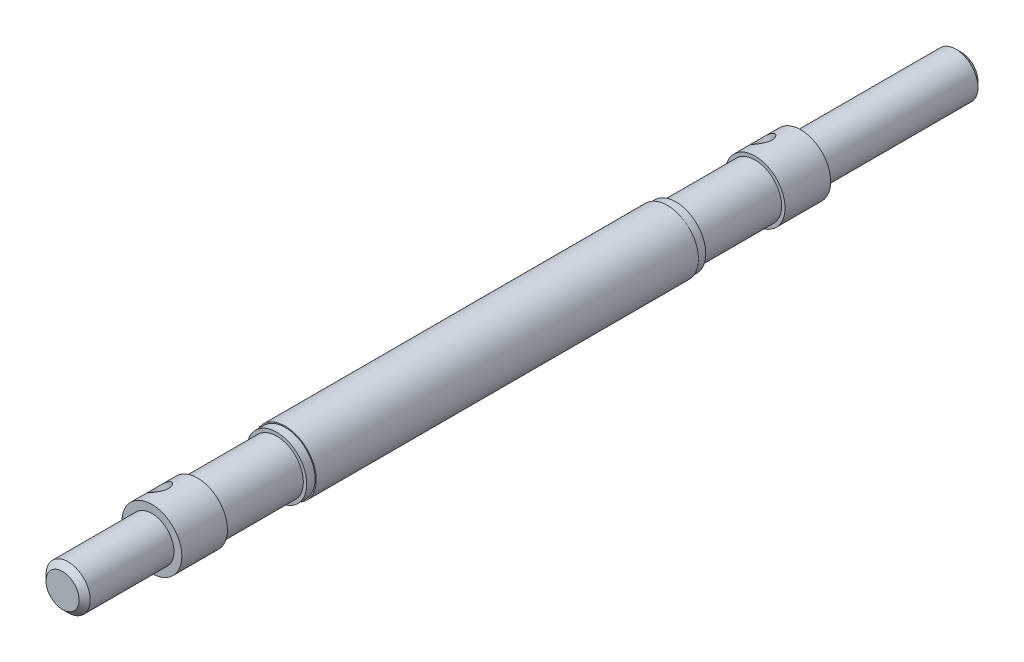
ISO-10303-21;
HEADER;
FILE_DESCRIPTION(('STEP AP214'),'2;1');
FILE_NAME('part.step','',(''),(''),'','','');
FILE_SCHEMA(('AUTOMOTIVE_DESIGN { 1 0 10303 214 1 1 1 1 }'));
ENDSEC;
DATA;
#1=APPLICATION_CONTEXT('core data for automotive mechanical design processes');
#2=APPLICATION_PROTOCOL_DEFINITION('international standard','automotive_design',2000,#1);
#3=PRODUCT_CONTEXT('',#1,'mechanical');
#4=PRODUCT('Part','Part','',(#3));
#5=PRODUCT_RELATED_PRODUCT_CATEGORY('part','',(#4));
#6=PRODUCT_DEFINITION_FORMATION('','',#4);
#7=PRODUCT_DEFINITION_CONTEXT('part definition',#1,'design');
#8=PRODUCT_DEFINITION('design','',#6,#7);
#9=PRODUCT_DEFINITION_SHAPE('','',#8);
#10=(LENGTH_UNIT() NAMED_UNIT(*) SI_UNIT(.MILLI.,.METRE.));
#11=(NAMED_UNIT(*) PLANE_ANGLE_UNIT() SI_UNIT($,.RADIAN.));
#12=(NAMED_UNIT(*) SI_UNIT($,.STERADIAN.) SOLID_ANGLE_UNIT());
#13=UNCERTAINTY_MEASURE_WITH_UNIT(LENGTH_MEASURE(1.E-05),#10,'distance_accuracy_value','');
#14=(GEOMETRIC_REPRESENTATION_CONTEXT(3) GLOBAL_UNCERTAINTY_ASSIGNED_CONTEXT((#13)) GLOBAL_UNIT_ASSIGNED_CONTEXT((#10,
#11,#12)) REPRESENTATION_CONTEXT('',''));
#15=CARTESIAN_POINT('',(0.,0.,0.));
#16=DIRECTION('',(0.,0.,1.));
#17=DIRECTION('',(1.,0.,0.));
#18=AXIS2_PLACEMENT_3D('',#15,#16,#17);
#19=CARTESIAN_POINT('',(0.,0.,112.3));
#20=DIRECTION('',(0.,0.,1.));
#21=DIRECTION('',(1.,0.,0.));
#22=AXIS2_PLACEMENT_3D('',#19,#20,#21);
#23=CYLINDRICAL_SURFACE('',#22,10.7);
#24=CARTESIAN_POINT('',(-8.01720753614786,7.08621078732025,120.45000000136));
#25=CARTESIAN_POINT('',(-8.01720712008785,7.08621157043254,120.542779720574));
#26=CARTESIAN_POINT('',(-8.01455246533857,7.08921896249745,120.63556517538));
#27=CARTESIAN_POINT('',(-8.00395107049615,7.10118428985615,120.820458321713));
#28=CARTESIAN_POINT('',(-7.99600218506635,7.11014463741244,120.912565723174));
#29=CARTESIAN_POINT('',(-7.9642128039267,7.14579737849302,121.187084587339));
#30=CARTESIAN_POINT('',(-7.93242960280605,7.18126122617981,121.367577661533));
#31=CARTESIAN_POINT('',(-7.84832169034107,7.27307684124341,121.717510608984));
#32=CARTESIAN_POINT('',(-7.79604652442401,7.32937820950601,121.886976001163));
#33=CARTESIAN_POINT('',(-7.6716353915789,7.45949653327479,122.211208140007));
#34=CARTESIAN_POINT('',(-7.59950186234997,7.53331133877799,122.36597668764));
#35=CARTESIAN_POINT('',(-7.43351200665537,7.69720098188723,122.661963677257));
#36=CARTESIAN_POINT('',(-7.33902833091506,7.78772465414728,122.8025816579));
#37=CARTESIAN_POINT('',(-7.13080570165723,7.97881913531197,123.060920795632));
#38=CARTESIAN_POINT('',(-7.01706296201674,8.07939191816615,123.178637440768));
#39=CARTESIAN_POINT('',(-6.76897529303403,8.28841677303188,123.390474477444));
#40=CARTESIAN_POINT('',(-6.63420993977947,8.39699827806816,123.48397709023));
#41=CARTESIAN_POINT('',(-6.34862680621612,8.61493723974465,123.640659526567));
#42=CARTESIAN_POINT('',(-6.197813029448,8.72429449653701,123.703846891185));
#43=CARTESIAN_POINT('',(-5.88875860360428,8.93568351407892,123.796101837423));
#44=CARTESIAN_POINT('',(-5.73090736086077,9.03783765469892,123.826191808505));
#45=CARTESIAN_POINT('',(-5.40791009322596,9.23473046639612,123.854640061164));
#46=CARTESIAN_POINT('',(-5.242765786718,9.32947086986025,123.853005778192));
#47=CARTESIAN_POINT('',(-4.91623765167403,9.50546188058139,123.818718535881));
#48=CARTESIAN_POINT('',(-4.7549299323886,9.58707323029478,123.787174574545));
#49=CARTESIAN_POINT('',(-4.43512043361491,9.73915180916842,123.695786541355));
#50=CARTESIAN_POINT('',(-4.27661885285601,9.80961825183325,123.635940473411));
#51=CARTESIAN_POINT('',(-3.96526354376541,9.93959387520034,123.488948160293));
#52=CARTESIAN_POINT('',(-3.81250521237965,9.99895503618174,123.401469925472));
#53=CARTESIAN_POINT('',(-3.51938507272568,10.1058549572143,123.201972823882));
#54=CARTESIAN_POINT('',(-3.37902580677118,10.1533912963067,123.089948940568));
#55=CARTESIAN_POINT('',(-3.10936553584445,10.239274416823,122.838878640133));
#56=CARTESIAN_POINT('',(-2.98079638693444,10.2771399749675,122.698879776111));
#57=CARTESIAN_POINT('',(-2.74641347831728,10.3422457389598,122.398716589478));
#58=CARTESIAN_POINT('',(-2.64061058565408,10.3694808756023,122.23854269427));
#59=CARTESIAN_POINT('',(-2.45491343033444,10.4150238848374,121.899788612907));
#60=CARTESIAN_POINT('',(-2.3753628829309,10.4332147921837,121.721001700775));
#61=CARTESIAN_POINT('',(-2.27986345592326,10.4543412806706,121.444535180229));
#62=CARTESIAN_POINT('',(-2.2520085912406,10.460355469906,121.351042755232));
#63=CARTESIAN_POINT('',(-2.20452729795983,10.4704660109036,121.161901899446));
#64=CARTESIAN_POINT('',(-2.18489707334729,10.4745632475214,121.066254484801));
#65=CARTESIAN_POINT('',(-2.15580959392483,10.4805857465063,120.884006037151));
#66=CARTESIAN_POINT('',(-2.14548006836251,10.4826983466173,120.797548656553));
#67=CARTESIAN_POINT('',(-2.13169223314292,10.4855108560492,120.624062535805));
#68=CARTESIAN_POINT('',(-2.12823395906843,10.4862107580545,120.5370337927));
#69=CARTESIAN_POINT('',(-2.12823567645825,10.4862108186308,120.357220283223));
#70=CARTESIAN_POINT('',(-2.13216748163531,10.4854155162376,120.264434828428));
#71=CARTESIAN_POINT('',(-2.14783045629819,10.4822171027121,120.079541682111));
#72=CARTESIAN_POINT('',(-2.15956478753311,10.479813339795,119.987434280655));
#73=CARTESIAN_POINT('',(-2.20633565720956,10.4701092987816,119.712915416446));
#74=CARTESIAN_POINT('',(-2.252939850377,10.4603161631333,119.532422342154));
#75=CARTESIAN_POINT('',(-2.3745084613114,10.4333843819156,119.182489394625));
#76=CARTESIAN_POINT('',(-2.44940445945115,10.4162634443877,119.013024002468));
#77=CARTESIAN_POINT('',(-2.62429579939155,10.3735794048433,118.688791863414));
#78=CARTESIAN_POINT('',(-2.7242880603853,10.3480173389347,118.534023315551));
#79=CARTESIAN_POINT('',(-2.94921558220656,10.2862107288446,118.238036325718));
#80=CARTESIAN_POINT('',(-3.07485321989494,10.2496473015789,118.097418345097));
#81=CARTESIAN_POINT('',(-3.34445720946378,10.1648684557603,117.839079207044));
#82=CARTESIAN_POINT('',(-3.48842716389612,10.1166507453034,117.721362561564));
#83=CARTESIAN_POINT('',(-3.79349183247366,10.0063129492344,117.509525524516));
#84=CARTESIAN_POINT('',(-3.95490885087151,9.9438934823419,117.416022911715));
#85=CARTESIAN_POINT('',(-4.28644109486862,9.80554071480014,117.259340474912));
#86=CARTESIAN_POINT('',(-4.45655414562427,9.72961078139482,117.196153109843));
#87=CARTESIAN_POINT('',(-4.79414961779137,9.56765630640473,117.103898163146));
#88=CARTESIAN_POINT('',(-4.9615433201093,9.48203019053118,117.073808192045));
#89=CARTESIAN_POINT('',(-5.29355613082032,9.30075275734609,117.045359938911));
#90=CARTESIAN_POINT('',(-5.45817588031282,9.20510379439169,117.046994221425));
#91=CARTESIAN_POINT('',(-5.77385263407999,9.01031763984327,117.081281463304));
#92=CARTESIAN_POINT('',(-5.92518399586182,8.91142673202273,117.112825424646));
#93=CARTESIAN_POINT('',(-6.21679265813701,8.71050287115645,117.204213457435));
#94=CARTESIAN_POINT('',(-6.35706917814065,8.60846969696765,117.264059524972));
#95=CARTESIAN_POINT('',(-6.62530902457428,8.40381590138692,117.411051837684));
#96=CARTESIAN_POINT('',(-6.75309646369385,8.30120388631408,117.498530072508));
#97=CARTESIAN_POINT('',(-6.9922345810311,8.10080435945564,117.698027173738));
#98=CARTESIAN_POINT('',(-7.10358189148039,8.00301783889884,117.81005105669));
#99=CARTESIAN_POINT('',(-7.3127889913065,7.81242675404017,118.061121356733));
#100=CARTESIAN_POINT('',(-7.40986610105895,7.72001538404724,118.201120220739));
#101=CARTESIAN_POINT('',(-7.58344080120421,7.54958671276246,118.501283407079));
#102=CARTESIAN_POINT('',(-7.65992856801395,7.47157628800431,118.661457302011));
#103=CARTESIAN_POINT('',(-7.79221854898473,7.33352933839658,119.000211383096));
#104=CARTESIAN_POINT('',(-7.8477476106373,7.27373199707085,119.178998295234));
#105=CARTESIAN_POINT('',(-7.91379340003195,7.2015903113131,119.455464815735));
#106=CARTESIAN_POINT('',(-7.93292927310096,7.18047438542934,119.548957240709));
#107=CARTESIAN_POINT('',(-7.96542590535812,7.14440964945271,119.738098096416));
#108=CARTESIAN_POINT('',(-7.97878932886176,7.12945799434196,119.833745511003));
#109=CARTESIAN_POINT('',(-7.99854870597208,7.10727874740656,120.01599395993));
#110=CARTESIAN_POINT('',(-8.00554303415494,7.0993894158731,120.102451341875));
#111=CARTESIAN_POINT('',(-8.01487265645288,7.08885505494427,120.275937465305));
#112=CARTESIAN_POINT('',(-8.01720792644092,7.08621005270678,120.362966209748));
#113=CARTESIAN_POINT('',(-8.01720753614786,7.08621078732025,120.45000000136));
#114=B_SPLINE_CURVE_WITH_KNOTS('',3,(#24,#25,#26,#27,#28,#29,#30,#31,#32,#33,#34,#35,#36,#37,
#38,#39,#40,#41,#42,#43,#44,#45,#46,#47,#48,#49,#50,#51,#52,#53,#54,#55,#56,#57,#58,#59,#60,#61,
#62,#63,#64,#65,#66,#67,#68,#69,#70,#71,#72,#73,#74,#75,#76,#77,#78,#79,#80,#81,#82,#83,#84,#85,
#86,#87,#88,#89,#90,#91,#92,#93,#94,#95,#96,#97,#98,#99,#100,#101,#102,#103,#104,#105,#106,#107,
#108,#109,#110,#111,#112,#113),.UNSPECIFIED.,.T.,.F.,(4,2,2,2,2,2,2,2,2,2,2,2,2,2,2,2,2,2,2,2,2,
2,2,2,2,2,2,2,2,2,2,2,2,2,2,2,2,2,2,2,2,2,2,2,4),(0.,0.27825205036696,0.556616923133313,
1.11368727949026,1.66941897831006,2.22508248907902,2.79872517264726,3.37248075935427,
3.95968527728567,4.54674364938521,5.11510863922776,5.68334041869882,6.23129456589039,
6.77928736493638,7.33413195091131,7.88909003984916,8.46783511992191,9.04685584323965,
9.63318173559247,9.92608014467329,10.2188432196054,10.4798615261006,10.7408811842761,
11.0191332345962,11.2974981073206,11.8545684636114,12.4103001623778,12.9659636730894,
13.5396063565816,14.1133619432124,14.7005664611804,15.2876248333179,15.8559898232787,
16.4242216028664,16.9721757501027,17.5201685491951,18.0750131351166,18.6299712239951,
19.2087163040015,19.7877370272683,20.3740629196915,20.6669613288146,20.9597244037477,
21.220742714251,21.4817623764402),.UNSPECIFIED.);
#115=CARTESIAN_POINT('',(-8.01720753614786,7.08621078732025,120.45000000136));
#116=VERTEX_POINT('',#115);
#117=EDGE_CURVE('E62',#116,#116,#114,.T.);
#118=ORIENTED_EDGE('',*,*,#117,.F.);
#119=EDGE_LOOP('',(#118));
#120=FACE_BOUND('',#119,.T.);
#121=CARTESIAN_POINT('',(0.,0.,112.3));
#122=DIRECTION('',(0.,0.,1.));
#123=DIRECTION('',(1.,0.,0.));
#124=AXIS2_PLACEMENT_3D('',#121,#122,#123);
#125=CIRCLE('',#124,10.7);
#126=CARTESIAN_POINT('',(10.7,0.,112.3));
#127=VERTEX_POINT('',#126);
#128=EDGE_CURVE('E66',#127,#127,#125,.T.);
#129=ORIENTED_EDGE('',*,*,#128,.T.);
#130=EDGE_LOOP('',(#129));
#131=FACE_BOUND('',#130,.T.);
#132=CARTESIAN_POINT('',(0.,0.,128.6));
#133=DIRECTION('',(0.,0.,1.));
#134=DIRECTION('',(1.,0.,0.));
#135=AXIS2_PLACEMENT_3D('',#132,#133,#134);
#136=CIRCLE('',#135,10.7);
#137=CARTESIAN_POINT('',(10.7,0.,128.6));
#138=VERTEX_POINT('',#137);
#139=EDGE_CURVE('E137',#138,#138,#136,.T.);
#140=ORIENTED_EDGE('',*,*,#139,.F.);
#141=EDGE_LOOP('',(#140));
#142=FACE_BOUND('',#141,.T.);
#143=ADVANCED_FACE('F37',(#120,#131,#142),#23,.T.);
#144=CARTESIAN_POINT('',(0.,0.,-86.8));
#145=DIRECTION('',(0.,0.,-1.));
#146=DIRECTION('',(0.,1.,0.));
#147=AXIS2_PLACEMENT_3D('',#144,#145,#146);
#148=CYLINDRICAL_SURFACE('',#147,10.7);
#149=CARTESIAN_POINT('',(-2.12823479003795,10.4862107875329,-94.9500000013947));
#150=CARTESIAN_POINT('',(-2.12823567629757,10.4862108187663,-95.0427797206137));
#151=CARTESIAN_POINT('',(-2.13216748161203,10.4854155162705,-95.1355651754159));
#152=CARTESIAN_POINT('',(-2.14783045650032,10.4822171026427,-95.3204583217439));
#153=CARTESIAN_POINT('',(-2.15956478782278,10.4798133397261,-95.4125657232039));
#154=CARTESIAN_POINT('',(-2.20633565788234,10.4701092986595,-95.6870845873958));
#155=CARTESIAN_POINT('',(-2.25293985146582,10.4603161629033,-95.867577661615));
#156=CARTESIAN_POINT('',(-2.37450846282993,10.4333843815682,-96.2175106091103));
#157=CARTESIAN_POINT('',(-2.44940446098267,10.416263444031,-96.3869760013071));
#158=CARTESIAN_POINT('',(-2.62429580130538,10.3735794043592,-96.7112081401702));
#159=CARTESIAN_POINT('',(-2.72428806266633,10.3480173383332,-96.8659766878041));
#160=CARTESIAN_POINT('',(-2.94921558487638,10.286210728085,-97.1619636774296));
#161=CARTESIAN_POINT('',(-3.07485322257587,10.2496473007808,-97.3025816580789));
#162=CARTESIAN_POINT('',(-3.34445721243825,10.1648684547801,-97.5609207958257));
#163=CARTESIAN_POINT('',(-3.48842716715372,10.1166507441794,-97.6786374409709));
#164=CARTESIAN_POINT('',(-3.79349183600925,10.0063129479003,-97.89047447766));
#165=CARTESIAN_POINT('',(-3.95490885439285,9.94389348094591,-97.9839770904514));
#166=CARTESIAN_POINT('',(-4.28644109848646,9.805540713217,-98.1406595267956));
#167=CARTESIAN_POINT('',(-4.4565541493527,9.7296107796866,-98.2038468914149));
#168=CARTESIAN_POINT('',(-4.79414962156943,9.56765630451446,-98.2961018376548));
#169=CARTESIAN_POINT('',(-4.96154332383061,9.48203018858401,-98.3261918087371));
#170=CARTESIAN_POINT('',(-5.29355613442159,9.30075275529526,-98.3546400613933));
#171=CARTESIAN_POINT('',(-5.45817588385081,9.20510379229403,-98.3530057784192));
#172=CARTESIAN_POINT('',(-5.77385263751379,9.010317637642,-98.3187185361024));
#173=CARTESIAN_POINT('',(-5.92518399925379,8.9114267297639,-98.2871745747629));
#174=CARTESIAN_POINT('',(-6.21679266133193,8.71050286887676,-98.195786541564));
#175=CARTESIAN_POINT('',(-6.3570691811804,8.60846969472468,-98.1359404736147));
#176=CARTESIAN_POINT('',(-6.62530902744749,8.40381589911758,-97.9889481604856));
#177=CARTESIAN_POINT('',(-6.75309646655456,8.30120388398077,-97.9014699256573));
#178=CARTESIAN_POINT('',(-6.99223458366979,8.10080435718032,-97.7019728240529));
#179=CARTESIAN_POINT('',(-7.10358189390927,8.0030178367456,-97.5899489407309));
#180=CARTESIAN_POINT('',(-7.31278899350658,7.81242675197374,-97.3388786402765));
#181=CARTESIAN_POINT('',(-7.40986610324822,7.72001538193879,-97.198879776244));
#182=CARTESIAN_POINT('',(-7.58344080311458,7.54958671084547,-96.8987165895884));
#183=CARTESIAN_POINT('',(-7.65992856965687,7.47157628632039,-96.7385426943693));
#184=CARTESIAN_POINT('',(-7.79221855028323,7.33352933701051,-96.3997886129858));
#185=CARTESIAN_POINT('',(-7.8477476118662,7.27373199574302,-96.2210017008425));
#186=CARTESIAN_POINT('',(-7.91379340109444,7.20159031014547,-95.9445351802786));
#187=CARTESIAN_POINT('',(-7.93292927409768,7.1804743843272,-95.8510427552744));
#188=CARTESIAN_POINT('',(-7.96542590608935,7.14440964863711,-95.6619018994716));
#189=CARTESIAN_POINT('',(-7.97878932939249,7.12945799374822,-95.5662544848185));
#190=CARTESIAN_POINT('',(-7.99854870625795,7.10727874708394,-95.3840060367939));
#191=CARTESIAN_POINT('',(-8.0055430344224,7.0993894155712,-95.2975486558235));
#192=CARTESIAN_POINT('',(-8.01487265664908,7.08885505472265,-95.1240625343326));
#193=CARTESIAN_POINT('',(-8.01720792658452,7.08621005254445,-95.0370337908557));
#194=CARTESIAN_POINT('',(-8.01720712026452,7.08621157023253,-94.8572202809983));
#195=CARTESIAN_POINT('',(-8.0145524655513,7.08921896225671,-94.7644348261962));
#196=CARTESIAN_POINT('',(-8.00395107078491,7.10118428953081,-94.5795416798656));
#197=CARTESIAN_POINT('',(-7.99600218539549,7.11014463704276,-94.4874342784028));
#198=CARTESIAN_POINT('',(-7.96421280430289,7.14579737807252,-94.2129154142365));
#199=CARTESIAN_POINT('',(-7.93242960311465,7.18126122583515,-94.032422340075));
#200=CARTESIAN_POINT('',(-7.84832169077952,7.27307684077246,-93.6824893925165));
#201=CARTESIAN_POINT('',(-7.79604652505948,7.32937820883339,-93.5130240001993));
#202=CARTESIAN_POINT('',(-7.67163539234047,7.45949653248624,-93.1887918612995));
#203=CARTESIAN_POINT('',(-7.59950186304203,7.53331133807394,-93.0340233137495));
#204=CARTESIAN_POINT('',(-7.43351200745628,7.69720098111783,-92.7380363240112));
#205=CARTESIAN_POINT('',(-7.33902833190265,7.7877246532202,-92.597418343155));
#206=CARTESIAN_POINT('',(-7.13080570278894,7.97881913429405,-92.339079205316));
#207=CARTESIAN_POINT('',(-7.01706296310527,8.07939191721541,-92.2213625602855));
#208=CARTESIAN_POINT('',(-6.76897529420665,8.28841677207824,-92.0095255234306));
#209=CARTESIAN_POINT('',(-6.63420994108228,8.39699827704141,-91.9160229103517));
#210=CARTESIAN_POINT('',(-6.34862680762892,8.61493723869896,-91.7593404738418));
#211=CARTESIAN_POINT('',(-6.19781303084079,8.72429449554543,-91.6961531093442));
#212=CARTESIAN_POINT('',(-5.88875860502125,8.93568351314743,-91.6038981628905));
#213=CARTESIAN_POINT('',(-5.73090736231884,9.03783765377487,-91.573808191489));
#214=CARTESIAN_POINT('',(-5.40791009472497,9.23473046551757,-91.545359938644));
#215=CARTESIAN_POINT('',(-5.24276578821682,9.32947086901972,-91.5469942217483));
#216=CARTESIAN_POINT('',(-4.91623765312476,9.50546187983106,-91.5812814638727));
#217=CARTESIAN_POINT('',(-4.7549299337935,9.58707322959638,-91.6128254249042));
#218=CARTESIAN_POINT('',(-4.43512043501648,9.73915180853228,-91.7042134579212));
#219=CARTESIAN_POINT('',(-4.27661885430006,9.80961825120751,-91.7640595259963));
#220=CARTESIAN_POINT('',(-3.96526354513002,9.93959387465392,-91.9110518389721));
#221=CARTESIAN_POINT('',(-3.81250521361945,9.99895503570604,-91.9985300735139));
#222=CARTESIAN_POINT('',(-3.51938507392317,10.1058549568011,-92.1980271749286));
#223=CARTESIAN_POINT('',(-3.37902580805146,10.1533912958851,-92.3100510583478));
#224=CARTESIAN_POINT('',(-3.1093655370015,10.2392744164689,-92.5611213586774));
#225=CARTESIAN_POINT('',(-2.98079638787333,10.2771399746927,-92.701120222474));
#226=CARTESIAN_POINT('',(-2.74641347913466,10.3422457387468,-93.0012834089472));
#227=CARTESIAN_POINT('',(-2.64061058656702,10.3694808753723,-93.1614573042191));
#228=CARTESIAN_POINT('',(-2.4549134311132,10.4150238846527,-93.5002113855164));
#229=CARTESIAN_POINT('',(-2.37536288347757,10.4332147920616,-93.6789982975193));
#230=CARTESIAN_POINT('',(-2.27986345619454,10.4543412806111,-93.9554648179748));
#231=CARTESIAN_POINT('',(-2.25200859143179,10.4603554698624,-94.0489572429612));
#232=CARTESIAN_POINT('',(-2.2045272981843,10.4704660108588,-94.2380980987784));
#233=CARTESIAN_POINT('',(-2.18489707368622,10.4745632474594,-94.3337455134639));
#234=CARTESIAN_POINT('',(-2.1558095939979,10.4805857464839,-94.5159939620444));
#235=CARTESIAN_POINT('',(-2.14548006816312,10.4826983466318,-94.602451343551));
#236=CARTESIAN_POINT('',(-2.13169223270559,10.4855108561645,-94.7759374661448));
#237=CARTESIAN_POINT('',(-2.12823395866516,10.4862107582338,-94.8629662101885));
#238=CARTESIAN_POINT('',(-2.12823479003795,10.4862107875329,-94.9500000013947));
#239=B_SPLINE_CURVE_WITH_KNOTS('',3,(#149,#150,#151,#152,#153,#154,#155,#156,#157,#158,#159,
#160,#161,#162,#163,#164,#165,#166,#167,#168,#169,#170,#171,#172,#173,#174,#175,#176,#177,#178,
#179,#180,#181,#182,#183,#184,#185,#186,#187,#188,#189,#190,#191,#192,#193,#194,#195,#196,#197,
#198,#199,#200,#201,#202,#203,#204,#205,#206,#207,#208,#209,#210,#211,#212,#213,#214,#215,#216,
#217,#218,#219,#220,#221,#222,#223,#224,#225,#226,#227,#228,#229,#230,#231,#232,#233,#234,#235,
#236,#237,#238),.UNSPECIFIED.,.T.,.F.,(4,2,2,2,2,2,2,2,2,2,2,2,2,2,2,2,2,2,2,2,2,2,2,2,2,2,2,2,
2,2,2,2,2,2,2,2,2,2,2,2,2,2,2,2,4),(0.,0.278252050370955,0.556616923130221,1.11368727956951,
1.66941897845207,2.22508248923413,2.79872517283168,3.37248075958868,3.95968527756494,
4.54674364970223,5.11510863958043,5.68334041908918,6.23129456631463,6.77928736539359,
7.33413195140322,7.88909004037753,8.46783512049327,9.04685584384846,9.63318173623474,
9.9260801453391,10.2188432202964,10.4798615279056,10.7408811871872,11.0191332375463,
11.2974981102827,11.854568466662,12.4103001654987,12.9659636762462,13.5396063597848,
14.1133619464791,14.7005664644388,15.2876248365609,15.8559898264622,16.4242216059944,
16.9721757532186,17.5201685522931,18.0750131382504,18.6299712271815,19.2087163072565,
19.7877370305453,20.3740629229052,20.6669613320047,20.9597244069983,21.2207427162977,
21.4817623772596),.UNSPECIFIED.);
#240=CARTESIAN_POINT('',(-2.12823479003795,10.4862107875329,-94.9500000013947));
#241=VERTEX_POINT('',#240);
#242=EDGE_CURVE('E75',#241,#241,#239,.T.);
#243=ORIENTED_EDGE('',*,*,#242,.F.);
#244=EDGE_LOOP('',(#243));
#245=FACE_BOUND('',#244,.T.);
#246=CARTESIAN_POINT('',(0.,0.,-86.8));
#247=DIRECTION('',(0.,0.,-1.));
#248=DIRECTION('',(0.,1.,0.));
#249=AXIS2_PLACEMENT_3D('',#246,#247,#248);
#250=CIRCLE('',#249,10.7);
#251=CARTESIAN_POINT('',(0.,10.7,-86.8));
#252=VERTEX_POINT('',#251);
#253=EDGE_CURVE('E83',#252,#252,#250,.F.);
#254=ORIENTED_EDGE('',*,*,#253,.F.);
#255=EDGE_LOOP('',(#254));
#256=FACE_BOUND('',#255,.T.);
#257=CARTESIAN_POINT('',(0.,0.,-103.1));
#258=DIRECTION('',(0.,0.,-1.));
#259=DIRECTION('',(-1.,0.,0.));
#260=AXIS2_PLACEMENT_3D('',#257,#258,#259);
#261=CIRCLE('',#260,10.7);
#262=CARTESIAN_POINT('',(-10.7,0.,-103.1));
#263=VERTEX_POINT('',#262);
#264=EDGE_CURVE('E63',#263,#263,#261,.T.);
#265=ORIENTED_EDGE('',*,*,#264,.F.);
#266=EDGE_LOOP('',(#265));
#267=FACE_BOUND('',#266,.T.);
#268=ADVANCED_FACE('F55',(#245,#256,#267),#148,.T.);
#269=CARTESIAN_POINT('',(0.971463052,-1.682623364,120.45));
#270=DIRECTION('',(-0.500000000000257,0.86602540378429,0.));
#271=DIRECTION('',(-0.86602540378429,-0.500000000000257,0.));
#272=AXIS2_PLACEMENT_3D('',#269,#270,#271);
#273=CONICAL_SURFACE('',#272,0.,1.02974425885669);
#274=CARTESIAN_POINT('',(0.97146305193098,-1.6826233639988,120.45));
#275=VERTEX_POINT('',#274);
#276=VERTEX_LOOP('',#275);
#277=FACE_BOUND('',#276,.T.);
#278=CARTESIAN_POINT('',(-0.0499999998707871,0.0866025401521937,120.45));
#279=DIRECTION('',(-0.50000000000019,0.866025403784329,0.));
#280=DIRECTION('',(-0.866025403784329,-0.500000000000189,0.));
#281=AXIS2_PLACEMENT_3D('',#278,#279,#280);
#282=CIRCLE('',#281,3.4000000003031);
#283=CARTESIAN_POINT('',(-2.994486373,-1.61339746,120.45));
#284=VERTEX_POINT('',#283);
#285=EDGE_CURVE('E60',#284,#284,#282,.F.);
#286=ORIENTED_EDGE('',*,*,#285,.F.);
#287=EDGE_LOOP('',(#286));
#288=FACE_BOUND('',#287,.T.);
#289=ADVANCED_FACE('F51',(#277,#288),#273,.F.);
#290=CARTESIAN_POINT('',(-0.0499999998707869,0.086602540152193,120.45));
#291=DIRECTION('',(-0.500000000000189,0.866025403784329,0.));
#292=DIRECTION('',(-0.866025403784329,-0.500000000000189,0.));
#293=AXIS2_PLACEMENT_3D('',#290,#291,#292);
#294=CYLINDRICAL_SURFACE('',#293,3.40000000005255);
#295=ORIENTED_EDGE('',*,*,#285,.T.);
#296=EDGE_LOOP('',(#295));
#297=FACE_BOUND('',#296,.T.);
#298=ORIENTED_EDGE('',*,*,#117,.T.);
#299=EDGE_LOOP('',(#298));
#300=FACE_BOUND('',#299,.T.);
#301=ADVANCED_FACE('F54',(#297,#300),#294,.F.);
#302=CARTESIAN_POINT('',(-10.8284,-10.8284,112.3));
#303=DIRECTION('',(0.,0.,1.));
#304=DIRECTION('',(1.,0.,0.));
#305=AXIS2_PLACEMENT_3D('',#302,#303,#304);
#306=PLANE('',#305);
#307=CARTESIAN_POINT('',(0.,0.,112.3));
#308=DIRECTION('',(0.,0.,1.));
#309=DIRECTION('',(1.,0.,0.));
#310=AXIS2_PLACEMENT_3D('',#307,#308,#309);
#311=CIRCLE('',#310,9.5);
#312=CARTESIAN_POINT('',(9.5,0.,112.3));
#313=VERTEX_POINT('',#312);
#314=EDGE_CURVE('E198',#313,#313,#311,.T.);
#315=ORIENTED_EDGE('',*,*,#314,.T.);
#316=EDGE_LOOP('',(#315));
#317=FACE_BOUND('',#316,.T.);
#318=ORIENTED_EDGE('',*,*,#128,.F.);
#319=EDGE_LOOP('',(#318));
#320=FACE_BOUND('',#319,.T.);
#321=ADVANCED_FACE('F187',(#317,#320),#306,.F.);
#322=CARTESIAN_POINT('',(0.,0.,84.));
#323=DIRECTION('',(0.,0.,1.));
#324=DIRECTION('',(1.,0.,0.));
#325=AXIS2_PLACEMENT_3D('',#322,#323,#324);
#326=CYLINDRICAL_SURFACE('',#325,9.5);
#327=CARTESIAN_POINT('',(0.,0.,84.));
#328=DIRECTION('',(0.,0.,1.));
#329=DIRECTION('',(1.,0.,0.));
#330=AXIS2_PLACEMENT_3D('',#327,#328,#329);
#331=CIRCLE('',#330,9.5);
#332=CARTESIAN_POINT('',(9.5,0.,84.));
#333=VERTEX_POINT('',#332);
#334=EDGE_CURVE('E201',#333,#333,#331,.F.);
#335=ORIENTED_EDGE('',*,*,#334,.F.);
#336=EDGE_LOOP('',(#335));
#337=FACE_BOUND('',#336,.T.);
#338=ORIENTED_EDGE('',*,*,#314,.F.);
#339=EDGE_LOOP('',(#338));
#340=FACE_BOUND('',#339,.T.);
#341=ADVANCED_FACE('F129',(#337,#340),#326,.T.);
#342=CARTESIAN_POINT('',(-10.8284,-10.8284,84.));
#343=DIRECTION('',(0.,0.,1.));
#344=DIRECTION('',(1.,0.,0.));
#345=AXIS2_PLACEMENT_3D('',#342,#343,#344);
#346=PLANE('',#345);
#347=ORIENTED_EDGE('',*,*,#334,.T.);
#348=EDGE_LOOP('',(#347));
#349=FACE_BOUND('',#348,.T.);
#350=CARTESIAN_POINT('',(0.,0.,84.));
#351=DIRECTION('',(0.,0.,1.));
#352=DIRECTION('',(1.,0.,0.));
#353=AXIS2_PLACEMENT_3D('',#350,#351,#352);
#354=CIRCLE('',#353,10.7);
#355=CARTESIAN_POINT('',(10.7,0.,84.));
#356=VERTEX_POINT('',#355);
#357=EDGE_CURVE('E203',#356,#356,#354,.T.);
#358=ORIENTED_EDGE('',*,*,#357,.T.);
#359=EDGE_LOOP('',(#358));
#360=FACE_BOUND('',#359,.T.);
#361=ADVANCED_FACE('F183',(#349,#360),#346,.T.);
#362=CARTESIAN_POINT('',(0.,0.,81.));
#363=DIRECTION('',(0.,0.,1.));
#364=DIRECTION('',(1.,0.,0.));
#365=AXIS2_PLACEMENT_3D('',#362,#363,#364);
#366=CYLINDRICAL_SURFACE('',#365,10.7);
#367=CARTESIAN_POINT('',(0.,0.,81.));
#368=DIRECTION('',(0.,0.,1.));
#369=DIRECTION('',(1.,0.,0.));
#370=AXIS2_PLACEMENT_3D('',#367,#368,#369);
#371=CIRCLE('',#370,10.7);
#372=CARTESIAN_POINT('',(10.7,0.,81.));
#373=VERTEX_POINT('',#372);
#374=EDGE_CURVE('E208',#373,#373,#371,.F.);
#375=ORIENTED_EDGE('',*,*,#374,.F.);
#376=EDGE_LOOP('',(#375));
#377=FACE_BOUND('',#376,.T.);
#378=ORIENTED_EDGE('',*,*,#357,.F.);
#379=EDGE_LOOP('',(#378));
#380=FACE_BOUND('',#379,.T.);
#381=ADVANCED_FACE('F181',(#377,#380),#366,.T.);
#382=CARTESIAN_POINT('',(-11.2332,-11.2332,81.));
#383=DIRECTION('',(0.,0.,1.));
#384=DIRECTION('',(1.,0.,0.));
#385=AXIS2_PLACEMENT_3D('',#382,#383,#384);
#386=PLANE('',#385);
#387=ORIENTED_EDGE('',*,*,#374,.T.);
#388=EDGE_LOOP('',(#387));
#389=FACE_BOUND('',#388,.T.);
#390=CARTESIAN_POINT('',(0.,0.,81.));
#391=DIRECTION('',(0.,0.,-1.));
#392=DIRECTION('',(-1.,0.,0.));
#393=AXIS2_PLACEMENT_3D('',#390,#391,#392);
#394=CIRCLE('',#393,11.1);
#395=CARTESIAN_POINT('',(-11.1,0.,81.));
#396=VERTEX_POINT('',#395);
#397=EDGE_CURVE('E211',#396,#396,#394,.F.);
#398=ORIENTED_EDGE('',*,*,#397,.T.);
#399=EDGE_LOOP('',(#398));
#400=FACE_BOUND('',#399,.T.);
#401=ADVANCED_FACE('F178',(#389,#400),#386,.T.);
#402=CARTESIAN_POINT('',(0.,0.,81.));
#403=DIRECTION('',(0.,0.,-1.));
#404=DIRECTION('',(-1.,0.,0.));
#405=AXIS2_PLACEMENT_3D('',#402,#403,#404);
#406=CYLINDRICAL_SURFACE('',#405,11.1);
#407=ORIENTED_EDGE('',*,*,#397,.F.);
#408=EDGE_LOOP('',(#407));
#409=FACE_BOUND('',#408,.T.);
#410=CARTESIAN_POINT('',(0.,0.,-55.5));
#411=DIRECTION('',(0.,0.,-1.));
#412=DIRECTION('',(-1.,0.,0.));
#413=AXIS2_PLACEMENT_3D('',#410,#411,#412);
#414=CIRCLE('',#413,11.1);
#415=CARTESIAN_POINT('',(-11.1,0.,-55.5));
#416=VERTEX_POINT('',#415);
#417=EDGE_CURVE('E214',#416,#416,#414,.T.);
#418=ORIENTED_EDGE('',*,*,#417,.F.);
#419=EDGE_LOOP('',(#418));
#420=FACE_BOUND('',#419,.T.);
#421=ADVANCED_FACE('F176',(#409,#420),#406,.T.);
#422=CARTESIAN_POINT('',(11.2332,-11.2332,-55.5));
#423=DIRECTION('',(0.,0.,-1.));
#424=DIRECTION('',(-1.,0.,0.));
#425=AXIS2_PLACEMENT_3D('',#422,#423,#424);
#426=PLANE('',#425);
#427=CARTESIAN_POINT('',(0.,0.,-55.5));
#428=DIRECTION('',(0.,0.,-1.));
#429=DIRECTION('',(0.,1.,0.));
#430=AXIS2_PLACEMENT_3D('',#427,#428,#429);
#431=CIRCLE('',#430,10.7);
#432=CARTESIAN_POINT('',(0.,10.7,-55.5));
#433=VERTEX_POINT('',#432);
#434=EDGE_CURVE('E217',#433,#433,#431,.F.);
#435=ORIENTED_EDGE('',*,*,#434,.T.);
#436=EDGE_LOOP('',(#435));
#437=FACE_BOUND('',#436,.T.);
#438=ORIENTED_EDGE('',*,*,#417,.T.);
#439=EDGE_LOOP('',(#438));
#440=FACE_BOUND('',#439,.T.);
#441=ADVANCED_FACE('F173',(#437,#440),#426,.T.);
#442=CARTESIAN_POINT('',(0.,0.,-55.5));
#443=DIRECTION('',(0.,0.,-1.));
#444=DIRECTION('',(0.,1.,0.));
#445=AXIS2_PLACEMENT_3D('',#442,#443,#444);
#446=CYLINDRICAL_SURFACE('',#445,10.7);
#447=ORIENTED_EDGE('',*,*,#434,.F.);
#448=EDGE_LOOP('',(#447));
#449=FACE_BOUND('',#448,.T.);
#450=CARTESIAN_POINT('',(0.,0.,-58.5));
#451=DIRECTION('',(0.,0.,-1.));
#452=DIRECTION('',(0.,1.,0.));
#453=AXIS2_PLACEMENT_3D('',#450,#451,#452);
#454=CIRCLE('',#453,10.7);
#455=CARTESIAN_POINT('',(0.,10.7,-58.5));
#456=VERTEX_POINT('',#455);
#457=EDGE_CURVE('E220',#456,#456,#454,.T.);
#458=ORIENTED_EDGE('',*,*,#457,.F.);
#459=EDGE_LOOP('',(#458));
#460=FACE_BOUND('',#459,.T.);
#461=ADVANCED_FACE('F171',(#449,#460),#446,.T.);
#462=CARTESIAN_POINT('',(10.8284,-10.8284,-58.5));
#463=DIRECTION('',(0.,0.,-1.));
#464=DIRECTION('',(-1.,0.,0.));
#465=AXIS2_PLACEMENT_3D('',#462,#463,#464);
#466=PLANE('',#465);
#467=CARTESIAN_POINT('',(0.,0.,-58.5));
#468=DIRECTION('',(0.,0.,-1.));
#469=DIRECTION('',(0.,1.,0.));
#470=AXIS2_PLACEMENT_3D('',#467,#468,#469);
#471=CIRCLE('',#470,9.5);
#472=CARTESIAN_POINT('',(0.,9.5,-58.5));
#473=VERTEX_POINT('',#472);
#474=EDGE_CURVE('E223',#473,#473,#471,.F.);
#475=ORIENTED_EDGE('',*,*,#474,.T.);
#476=EDGE_LOOP('',(#475));
#477=FACE_BOUND('',#476,.T.);
#478=ORIENTED_EDGE('',*,*,#457,.T.);
#479=EDGE_LOOP('',(#478));
#480=FACE_BOUND('',#479,.T.);
#481=ADVANCED_FACE('F168',(#477,#480),#466,.T.);
#482=CARTESIAN_POINT('',(0.,0.,-58.5));
#483=DIRECTION('',(0.,0.,-1.));
#484=DIRECTION('',(0.,1.,0.));
#485=AXIS2_PLACEMENT_3D('',#482,#483,#484);
#486=CYLINDRICAL_SURFACE('',#485,9.5);
#487=CARTESIAN_POINT('',(0.,0.,-86.8));
#488=DIRECTION('',(0.,0.,-1.));
#489=DIRECTION('',(0.,1.,0.));
#490=AXIS2_PLACEMENT_3D('',#487,#488,#489);
#491=CIRCLE('',#490,9.5);
#492=CARTESIAN_POINT('',(0.,9.50000000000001,-86.8));
#493=VERTEX_POINT('',#492);
#494=EDGE_CURVE('E225',#493,#493,#491,.F.);
#495=ORIENTED_EDGE('',*,*,#494,.T.);
#496=EDGE_LOOP('',(#495));
#497=FACE_BOUND('',#496,.T.);
#498=ORIENTED_EDGE('',*,*,#474,.F.);
#499=EDGE_LOOP('',(#498));
#500=FACE_BOUND('',#499,.T.);
#501=ADVANCED_FACE('F164',(#497,#500),#486,.T.);
#502=CARTESIAN_POINT('',(10.8284,-10.8284,-86.8));
#503=DIRECTION('',(0.,0.,-1.));
#504=DIRECTION('',(-1.,0.,0.));
#505=AXIS2_PLACEMENT_3D('',#502,#503,#504);
#506=PLANE('',#505);
#507=ORIENTED_EDGE('',*,*,#494,.F.);
#508=EDGE_LOOP('',(#507));
#509=FACE_BOUND('',#508,.T.);
#510=ORIENTED_EDGE('',*,*,#253,.T.);
#511=EDGE_LOOP('',(#510));
#512=FACE_BOUND('',#511,.T.);
#513=ADVANCED_FACE('F161',(#509,#512),#506,.F.);
#514=CARTESIAN_POINT('',(0.971463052,-1.682623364,-94.95));
#515=DIRECTION('',(-0.500000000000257,0.86602540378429,0.));
#516=DIRECTION('',(-0.86602540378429,-0.500000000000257,0.));
#517=AXIS2_PLACEMENT_3D('',#514,#515,#516);
#518=CONICAL_SURFACE('',#517,0.,1.02974425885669);
#519=CARTESIAN_POINT('',(0.97146305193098,-1.6826233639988,-94.95));
#520=VERTEX_POINT('',#519);
#521=VERTEX_LOOP('',#520);
#522=FACE_BOUND('',#521,.T.);
#523=CARTESIAN_POINT('',(-0.0499999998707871,0.0866025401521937,-94.95));
#524=DIRECTION('',(-0.50000000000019,0.866025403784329,0.));
#525=DIRECTION('',(-0.866025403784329,-0.500000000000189,0.));
#526=AXIS2_PLACEMENT_3D('',#523,#524,#525);
#527=CIRCLE('',#526,3.4000000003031);
#528=CARTESIAN_POINT('',(-2.994486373,-1.61339746,-94.95));
#529=VERTEX_POINT('',#528);
#530=EDGE_CURVE('E73',#529,#529,#527,.F.);
#531=ORIENTED_EDGE('',*,*,#530,.F.);
#532=EDGE_LOOP('',(#531));
#533=FACE_BOUND('',#532,.T.);
#534=ADVANCED_FACE('F91',(#522,#533),#518,.F.);
#535=CARTESIAN_POINT('',(-0.0499999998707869,0.086602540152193,-94.95));
#536=DIRECTION('',(-0.500000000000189,0.866025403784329,0.));
#537=DIRECTION('',(-0.866025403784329,-0.500000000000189,0.));
#538=AXIS2_PLACEMENT_3D('',#535,#536,#537);
#539=CYLINDRICAL_SURFACE('',#538,3.40000000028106);
#540=ORIENTED_EDGE('',*,*,#242,.T.);
#541=EDGE_LOOP('',(#540));
#542=FACE_BOUND('',#541,.T.);
#543=ORIENTED_EDGE('',*,*,#530,.T.);
#544=EDGE_LOOP('',(#543));
#545=FACE_BOUND('',#544,.T.);
#546=ADVANCED_FACE('F87',(#542,#545),#539,.F.);
#547=CARTESIAN_POINT('',(0.,0.,-103.1));
#548=DIRECTION('',(0.,0.,-1.));
#549=DIRECTION('',(-1.,0.,0.));
#550=AXIS2_PLACEMENT_3D('',#547,#548,#549);
#551=PLANE('',#550);
#552=CARTESIAN_POINT('',(0.,0.,-103.1));
#553=DIRECTION('',(0.,0.,-1.));
#554=DIRECTION('',(-1.,0.,0.));
#555=AXIS2_PLACEMENT_3D('',#552,#553,#554);
#556=CIRCLE('',#555,7.9);
#557=CARTESIAN_POINT('',(-7.9,0.,-103.1));
#558=VERTEX_POINT('',#557);
#559=EDGE_CURVE('E69',#558,#558,#556,.T.);
#560=ORIENTED_EDGE('',*,*,#559,.F.);
#561=EDGE_LOOP('',(#560));
#562=FACE_BOUND('',#561,.T.);
#563=ORIENTED_EDGE('',*,*,#264,.T.);
#564=EDGE_LOOP('',(#563));
#565=FACE_BOUND('',#564,.T.);
#566=ADVANCED_FACE('F57',(#562,#565),#551,.T.);
#567=CARTESIAN_POINT('',(0.,0.,-103.1));
#568=DIRECTION('',(0.,0.,-1.));
#569=DIRECTION('',(-1.,0.,0.));
#570=AXIS2_PLACEMENT_3D('',#567,#568,#569);
#571=CYLINDRICAL_SURFACE('',#570,7.9);
#572=CARTESIAN_POINT('',(0.,0.,-158.5));
#573=DIRECTION('',(0.,0.,1.));
#574=DIRECTION('',(1.,0.,0.));
#575=AXIS2_PLACEMENT_3D('',#572,#573,#574);
#576=CIRCLE('',#575,7.9);
#577=CARTESIAN_POINT('',(7.9,0.,-158.5));
#578=VERTEX_POINT('',#577);
#579=EDGE_CURVE('E143',#578,#578,#576,.T.);
#580=ORIENTED_EDGE('',*,*,#579,.T.);
#581=EDGE_LOOP('',(#580));
#582=FACE_BOUND('',#581,.T.);
#583=ORIENTED_EDGE('',*,*,#559,.T.);
#584=EDGE_LOOP('',(#583));
#585=FACE_BOUND('',#584,.T.);
#586=ADVANCED_FACE('F95',(#582,#585),#571,.T.);
#587=CARTESIAN_POINT('',(-10.8284,-10.8284,-160.5));
#588=DIRECTION('',(0.,0.,1.));
#589=DIRECTION('',(1.,0.,0.));
#590=AXIS2_PLACEMENT_3D('',#587,#588,#589);
#591=PLANE('',#590);
#592=CARTESIAN_POINT('',(0.,0.,-160.5));
#593=DIRECTION('',(0.,0.,1.));
#594=DIRECTION('',(1.,0.,0.));
#595=AXIS2_PLACEMENT_3D('',#592,#593,#594);
#596=CIRCLE('',#595,5.89999999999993);
#597=CARTESIAN_POINT('',(5.89999999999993,0.,-160.5));
#598=VERTEX_POINT('',#597);
#599=EDGE_CURVE('E82',#598,#598,#596,.F.);
#600=ORIENTED_EDGE('',*,*,#599,.T.);
#601=EDGE_LOOP('',(#600));
#602=FACE_BOUND('',#601,.T.);
#603=ADVANCED_FACE('F99',(#602),#591,.F.);
#604=CARTESIAN_POINT('',(0.,0.,128.6));
#605=DIRECTION('',(0.,0.,1.));
#606=DIRECTION('',(1.,0.,0.));
#607=AXIS2_PLACEMENT_3D('',#604,#605,#606);
#608=PLANE('',#607);
#609=CARTESIAN_POINT('',(0.,0.,128.6));
#610=DIRECTION('',(0.,0.,1.));
#611=DIRECTION('',(1.,0.,0.));
#612=AXIS2_PLACEMENT_3D('',#609,#610,#611);
#613=CIRCLE('',#612,7.9);
#614=CARTESIAN_POINT('',(7.9,0.,128.6));
#615=VERTEX_POINT('',#614);
#616=EDGE_CURVE('E140',#615,#615,#613,.T.);
#617=ORIENTED_EDGE('',*,*,#616,.F.);
#618=EDGE_LOOP('',(#617));
#619=FACE_BOUND('',#618,.T.);
#620=ORIENTED_EDGE('',*,*,#139,.T.);
#621=EDGE_LOOP('',(#620));
#622=FACE_BOUND('',#621,.T.);
#623=ADVANCED_FACE('F101',(#619,#622),#608,.T.);
#624=CARTESIAN_POINT('',(0.,0.,128.6));
#625=DIRECTION('',(0.,0.,1.));
#626=DIRECTION('',(1.,0.,0.));
#627=AXIS2_PLACEMENT_3D('',#624,#625,#626);
#628=CYLINDRICAL_SURFACE('',#627,7.9);
#629=CARTESIAN_POINT('',(0.,0.,158.5));
#630=DIRECTION('',(0.,0.,1.));
#631=DIRECTION('',(1.,0.,0.));
#632=AXIS2_PLACEMENT_3D('',#629,#630,#631);
#633=CIRCLE('',#632,7.9);
#634=CARTESIAN_POINT('',(7.9,0.,158.5));
#635=VERTEX_POINT('',#634);
#636=EDGE_CURVE('E12',#635,#635,#633,.F.);
#637=ORIENTED_EDGE('',*,*,#636,.T.);
#638=EDGE_LOOP('',(#637));
#639=FACE_BOUND('',#638,.T.);
#640=ORIENTED_EDGE('',*,*,#616,.T.);
#641=EDGE_LOOP('',(#640));
#642=FACE_BOUND('',#641,.T.);
#643=ADVANCED_FACE('F104',(#639,#642),#628,.T.);
#644=CARTESIAN_POINT('',(-10.8284,-10.8284,160.5));
#645=DIRECTION('',(0.,0.,1.));
#646=DIRECTION('',(1.,0.,0.));
#647=AXIS2_PLACEMENT_3D('',#644,#645,#646);
#648=PLANE('',#647);
#649=CARTESIAN_POINT('',(0.,0.,160.5));
#650=DIRECTION('',(0.,0.,1.));
#651=DIRECTION('',(1.,0.,0.));
#652=AXIS2_PLACEMENT_3D('',#649,#650,#651);
#653=CIRCLE('',#652,5.89999999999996);
#654=CARTESIAN_POINT('',(5.89999999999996,0.,160.5));
#655=VERTEX_POINT('',#654);
#656=EDGE_CURVE('E46',#655,#655,#653,.T.);
#657=ORIENTED_EDGE('',*,*,#656,.T.);
#658=EDGE_LOOP('',(#657));
#659=FACE_BOUND('',#658,.T.);
#660=ADVANCED_FACE('F107',(#659),#648,.T.);
#661=CARTESIAN_POINT('',(0.,0.,-160.5));
#662=DIRECTION('',(0.,0.,1.));
#663=DIRECTION('',(1.,0.,0.));
#664=AXIS2_PLACEMENT_3D('',#661,#662,#663);
#665=CONICAL_SURFACE('',#664,5.89999999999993,0.785398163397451);
#666=ORIENTED_EDGE('',*,*,#579,.F.);
#667=EDGE_LOOP('',(#666));
#668=FACE_BOUND('',#667,.T.);
#669=ORIENTED_EDGE('',*,*,#599,.F.);
#670=EDGE_LOOP('',(#669));
#671=FACE_BOUND('',#670,.T.);
#672=ADVANCED_FACE('F113',(#668,#671),#665,.T.);
#673=CARTESIAN_POINT('',(0.,0.,160.5));
#674=DIRECTION('',(0.,0.,-1.));
#675=DIRECTION('',(-1.,0.,0.));
#676=AXIS2_PLACEMENT_3D('',#673,#674,#675);
#677=CONICAL_SURFACE('',#676,5.89999999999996,0.785398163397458);
#678=ORIENTED_EDGE('',*,*,#636,.F.);
#679=EDGE_LOOP('',(#678));
#680=FACE_BOUND('',#679,.T.);
#681=ORIENTED_EDGE('',*,*,#656,.F.);
#682=EDGE_LOOP('',(#681));
#683=FACE_BOUND('',#682,.T.);
#684=ADVANCED_FACE('F39',(#680,#683),#677,.T.);
#685=CLOSED_SHELL('',(#143,#268,#289,#301,#321,#341,#361,#381,#401,#421,#441,#461,#481,#501,
#513,#534,#546,#566,#586,#603,#623,#643,#660,#672,#684));
#686=MANIFOLD_SOLID_BREP('B2',#685);
#687=ADVANCED_BREP_SHAPE_REPRESENTATION('',(#18,#686),#14);
#688=SHAPE_DEFINITION_REPRESENTATION(#9,#687);
ENDSEC;
END-ISO-10303-21;
